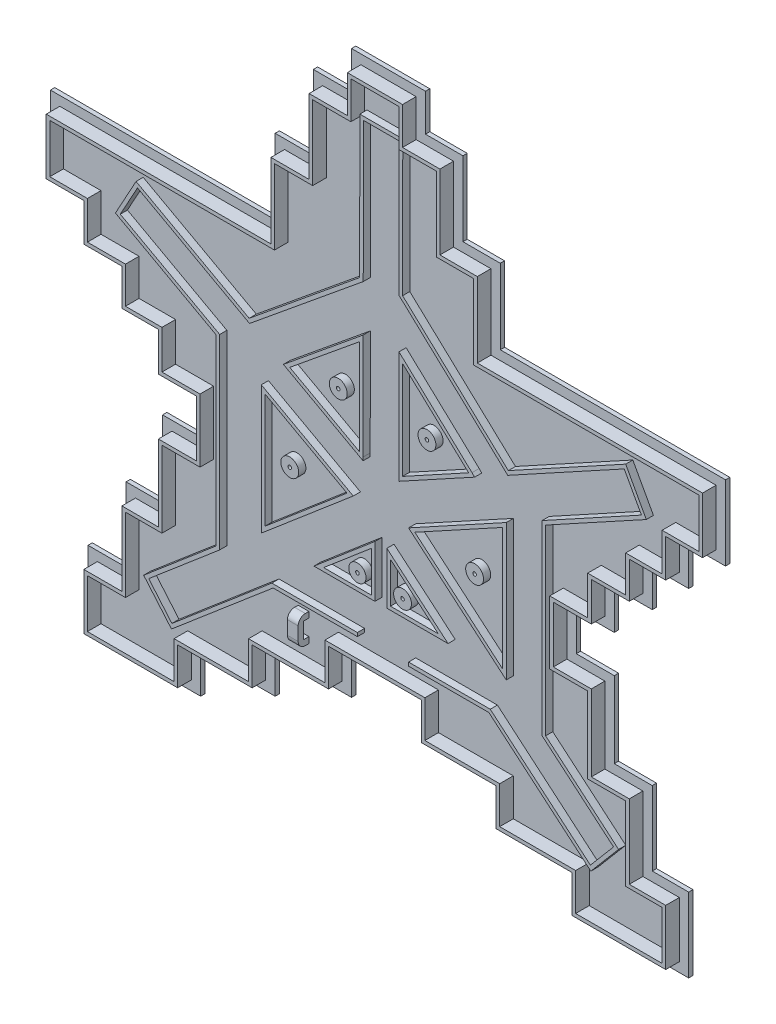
from build123d import *

# Parameters (mm, degrees)
BOSS_EXTRUDE1_DEPTH = 1.2
BOSS_EXTRUDE2_DEPTH = 5
SKETCH7_R           = 2.408517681
SKETCH7_R_2         = 0.5
SKETCH7_R_3         = 2.5
BOSS_EXTRUDE5_DEPTH = 2
SKETCH8_W           = 3
SKETCH8_H           = 7.788245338
BOSS_EXTRUDE6_DEPTH = 3
SKETCH9_W           = 1.552701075
SKETCH9_H           = 4.49127797
CUT_EXTRUDE6_DEPTH  = 5
FILLET6_R           = 2


with BuildPart() as part:
    # Sketch1 → Boss-Extrude1 (new body)
    with BuildSketch(Plane.XY):
        Polygon((-31.468980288, 100.324610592), (-31.468980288, 79.423487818), (-20.95658126, 79.423487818), (-20.95658126, 68.849251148), (-10.320506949, 68.849251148), (-10.320506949, 58.646040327), (-0.117296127, 58.646040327), (-0.117296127, 47.824453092), (10.518778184, 47.824453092), (10.518778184, 37.373891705), (-0.117296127, 37.373891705), (-0.117296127, 16.07112462), (-10.320506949, 16.07112462), (-10.320506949, -4.616109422), (-20.95658126, -4.616109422), (-20.95658126, -25.41279973), (10.518778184, -25.41279973), (10.518778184, -15.014454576), (31.334575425, -15.014454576), (31.334575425, -4.616109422), (52.678547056, -4.616109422), (52.678547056, 5.727507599), (73.365781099, 5.727507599), (73.365781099, -4.616109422), (94.271927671, -4.616109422), (94.271927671, -15.014454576), (115.506443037, -15.014454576), (115.506443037, -25.41279973), (146.920391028, -25.41279973), (146.920391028, -4.616109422), (136.740958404, -4.616109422), (136.740958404, 16.07112462), (126.12370072, 16.07112462), (126.12370072, 37.373891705), (115.506443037, 37.373891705), (115.506443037, 47.824453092), (126.12370072, 47.824453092), (126.12370072, 58.646040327), (136.740958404, 58.646040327), (136.740958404, 68.849251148), (146.920391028, 68.849251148), (146.920391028, 79.423487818), (157.209279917, 79.423487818), (157.209279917, 100.324610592), (94.271927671, 100.324610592), (94.271927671, 121.258595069), (83.818854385, 121.258595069), (83.818854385, 142.055285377), (73.365781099, 142.055285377), (73.365781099, 152.45363053), (52.678547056, 152.45363053), (52.678547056, 142.055285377), (42.00656124, 142.055285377), (42.00656124, 121.258595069), (31.334575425, 121.258595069), (31.334575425, 100.324610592), align=None)
    extrude(amount=BOSS_EXTRUDE1_DEPTH)

    # Sketch1_9 → Boss-Extrude2 (add)
    with BuildSketch(Plane.XY):
        Polygon((-28.843980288, 97.699610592), (-28.843980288, 82.048487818), (-18.33158126, 82.048487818), (-18.33158126, 71.474251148), (-7.695506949, 71.474251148), (-7.695506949, 61.271040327), (2.507703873, 61.271040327), (2.507703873, 50.449453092), (13.143778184, 50.449453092), (13.143778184, 34.748891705), (2.507703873, 34.748891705), (2.507703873, 13.44612462), (-7.695506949, 13.44612462), (-7.695506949, -7.241109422), (-18.33158126, -7.241109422), (-18.33158126, -22.78779973), (7.893778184, -22.78779973), (7.893778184, -12.389454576), (28.709575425, -12.389454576), (28.709575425, -1.991109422), (50.053547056, -1.991109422), (50.053547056, 8.352507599), (75.990781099, 8.352507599), (75.990781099, -1.991109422), (96.896927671, -1.991109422), (96.896927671, -12.389454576), (118.131443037, -12.389454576), (118.131443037, -22.78779973), (144.295391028, -22.78779973), (144.295391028, -7.241109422), (134.115958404, -7.241109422), (134.115958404, 13.44612462), (123.49870072, 13.44612462), (123.49870072, 34.748891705), (112.881443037, 34.748891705), (112.881443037, 50.449453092), (123.49870072, 50.449453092), (123.49870072, 61.271040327), (134.115958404, 61.271040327), (134.115958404, 71.474251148), (144.295391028, 71.474251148), (144.295391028, 82.048487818), (154.584279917, 82.048487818), (154.584279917, 97.699610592), (91.646927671, 97.699610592), (91.646927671, 118.633595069), (81.193854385, 118.633595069), (81.193854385, 139.430285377), (70.740781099, 139.430285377), (70.740781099, 149.82863053), (55.303547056, 149.82863053), (55.303547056, 139.430285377), (44.63156124, 139.430285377), (44.63156124, 118.633595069), (33.959575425, 118.633595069), (33.959575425, 97.699610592), align=None)
        Polygon((153.584279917, 96.699610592), (90.646927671, 96.699610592), (90.646927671, 117.633595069), (80.193854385, 117.633595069), (80.193854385, 138.430285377), (69.740781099, 138.430285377), (69.740781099, 148.82863053), (56.303547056, 148.82863053), (56.303547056, 138.430285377), (45.63156124, 138.430285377), (45.63156124, 117.633595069), (34.959575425, 117.633595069), (34.959575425, 96.699610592), (-27.843980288, 96.699610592), (-27.843980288, 83.048487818), (-17.33158126, 83.048487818), (-17.33158126, 72.474251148), (-6.695506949, 72.474251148), (-6.695506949, 62.271040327), (3.507703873, 62.271040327), (3.507703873, 51.449453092), (14.143778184, 51.449453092), (14.143778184, 33.748891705), (3.507703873, 33.748891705), (3.507703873, 12.44612462), (-6.695506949, 12.44612462), (-6.695506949, -8.241109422), (-17.33158126, -8.241109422), (-17.33158126, -21.78779973), (6.893778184, -21.78779973), (6.893778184, -11.389454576), (27.709575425, -11.389454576), (27.709575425, -0.991109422), (49.053547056, -0.991109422), (49.053547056, 9.352507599), (76.990781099, 9.352507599), (76.990781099, -0.991109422), (97.896927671, -0.991109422), (97.896927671, -11.389454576), (119.131443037, -11.389454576), (119.131443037, -21.78779973), (143.295391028, -21.78779973), (143.295391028, -8.241109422), (133.115958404, -8.241109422), (133.115958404, 12.44612462), (122.49870072, 12.44612462), (122.49870072, 33.748891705), (111.881443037, 33.748891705), (111.881443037, 51.449453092), (122.49870072, 51.449453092), (122.49870072, 62.271040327), (133.115958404, 62.271040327), (133.115958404, 72.474251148), (143.295391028, 72.474251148), (143.295391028, 83.048487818), (153.584279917, 83.048487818), align=None, mode=Mode.SUBTRACT)
    extrude(amount=BOSS_EXTRUDE2_DEPTH)

    # Sketch7 → Boss-Extrude5 (add)
    # profile 1 of 13: a face of its own
    with BuildSketch(Plane.XY.offset(1.2)):
        Polygon((67.948253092, 87.664335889), (67.911442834, 57.203881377), (67.911442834, 56.302360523), (89.090105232, 67.90002077), (88.353073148, 68.636535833), align=None)
        Polygon((87.42276229, 68.127087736), (68.9123943, 57.990613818), (68.945466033, 85.357443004), align=None, mode=Mode.SUBTRACT)
    # profile 2 of 13: a face of its own
    with BuildSketch(Plane.XY.offset(1.2)):
        Polygon((-11.296794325, 81.63498138), (16.844878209, 66.225560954), (16.844878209, 15.125179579), (-3.403951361, -2.080125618), (4.366204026, -11.224778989), (32.777648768, 12.916249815), (56.328190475, 12.916249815), (56.328190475, 13.916249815), (32.410172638, 13.916249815), (4.480745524, -9.815211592), (-1.994383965, -2.194667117), (17.844878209, 14.662631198), (17.844878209, 66.818095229), (-9.939399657, 82.031818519), (-5.13661201, 90.802977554), (26.188262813, 73.650544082), (57.962755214, 99.670870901), (58.009962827, 138.735128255), (68.009970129, 138.735128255), (67.964758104, 101.322218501), (68.963633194, 100.390752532), (98.361274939, 72.977011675), (130.913238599, 90.802812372), (135.716327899, 82.031818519), (107.93431821, 66.818095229), (107.93431821, 14.75133935), (127.919514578, -2.194667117), (121.452210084, -9.82185353), (93.456784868, 13.916249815), (70.624882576, 13.916249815), (70.624882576, 12.916249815), (93.089891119, 12.916249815), (121.568198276, -11.231302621), (129.328963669, -2.078678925), (108.93431821, 15.214510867), (108.93431821, 66.225584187), (137.073736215, 81.635028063), (131.310029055, 92.160220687), (98.514779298, 74.201193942), (68.965283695, 101.756540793), (69.01117932, 139.735128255), (57.011170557, 139.735128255), (56.963327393, 100.144953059), (26.076720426, 74.85172107), (-5.533449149, 92.160372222), align=None)
    # profile 3 of 13: a face of its own
    with BuildSketch(Plane.XY.offset(1.2)):
        Polygon((57.911391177, 56.280040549), (57.911391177, 57.167177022), (57.94712015, 86.732869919), (35.647071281, 68.471223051), align=None)
        Polygon((56.944565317, 84.61935188), (56.912357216, 57.967177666), (37.427290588, 68.636535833), align=None, mode=Mode.SUBTRACT)
    # profile 4 of 13: a face of its own
    with BuildSketch(Plane.XY.offset(1.2)):
        Polygon((29.473122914, 24.543078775), (55.171842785, 46.379122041), (29.473122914, 60.450864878), align=None)
        Polygon((30.473122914, 58.763198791), (53.41673431, 46.200059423), (30.473122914, 26.705014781), align=None, mode=Mode.SUBTRACT)
    # profile 5 of 13: a face of its own
    with BuildSketch(Plane.XY.offset(1.2)):
        Polygon((97.93431821, 61.341989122), (70.624882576, 46.387052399), (97.93431821, 23.23061879), align=None)
        Polygon((96.93431821, 25.389646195), (72.381352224, 46.208792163), (96.93431821, 59.65425686), align=None, mode=Mode.SUBTRACT)
    # profile 6 of 13: a face of its own
    with BuildSketch(Plane.XY.offset(1.2)):
        Polygon((61.240210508, 38.412954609), (44.179117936, 23.916249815), (61.240210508, 23.916249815), align=None)
        Polygon((60.240210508, 24.916249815), (46.900383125, 24.916249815), (60.240210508, 36.251018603), align=None, mode=Mode.SUBTRACT)
    # profile 7 of 13: a face of its own
    with BuildSketch(Plane.XY.offset(1.2)):
        Polygon((64.579575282, 23.916249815), (81.663329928, 23.916249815), (64.564694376, 38.414660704), align=None)
        Polygon((65.56691282, 36.253752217), (78.937745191, 24.916249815), (65.578549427, 24.916249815), align=None, mode=Mode.SUBTRACT)
    # profile 8 of 13: a face of its own
    with BuildSketch(Plane.XY.offset(1.2)):
        with Locations((56.328190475, 28.372721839)):
            Circle(SKETCH7_R)
        with Locations((56.328190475, 28.372721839)):
            Circle(SKETCH7_R_2, mode=Mode.SUBTRACT)
    # profile 9 of 13: a face of its own
    with BuildSketch(Plane.XY.offset(1.2)):
        with Locations((68.945466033, 28.372721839)):
            Circle(SKETCH7_R_3)
        with Locations((68.945466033, 28.372721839)):
            Circle(SKETCH7_R_2, mode=Mode.SUBTRACT)
    # profile 10 of 13: a face of its own
    with BuildSketch(Plane.XY.offset(1.2)):
        with Locations((37.427290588, 44.468761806)):
            Circle(SKETCH7_R_3)
        with Locations((37.427290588, 44.468761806)):
            Circle(SKETCH7_R_2, mode=Mode.SUBTRACT)
    # profile 11 of 13: a face of its own
    with BuildSketch(Plane.XY.offset(1.2)):
        with Locations((89.090105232, 44.468761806)):
            Circle(SKETCH7_R_3)
        with Locations((89.090105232, 44.468761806)):
            Circle(SKETCH7_R_2, mode=Mode.SUBTRACT)
    # profile 12 of 13: a face of its own
    with BuildSketch(Plane.XY.offset(1.2)):
        with Locations((50.983394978, 70.266444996)):
            Circle(SKETCH7_R_3)
        with Locations((50.983394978, 70.266444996)):
            Circle(SKETCH7_R_2, mode=Mode.SUBTRACT)
    # profile 13 of 13: a face of its own
    with BuildSketch(Plane.XY.offset(1.2)):
        with Locations((75.767111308, 70.266444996)):
            Circle(SKETCH7_R_3)
        with Locations((75.767111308, 70.266444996)):
            Circle(SKETCH7_R_2, mode=Mode.SUBTRACT)
    extrude(amount=BOSS_EXTRUDE5_DEPTH)

    # Sketch8 → Boss-Extrude6 (add)
    with BuildSketch(Plane.XY.offset(1.2)):
        with Locations((39.278396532, 6.350298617)):
            Rectangle(SKETCH8_W, SKETCH8_H)
    extrude(amount=BOSS_EXTRUDE6_DEPTH)

    # Sketch9 → Cut-Extrude6 (cut)
    with BuildSketch(Plane(origin=(40.778396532, 0, 0), x_dir=(0, 0, -1), z_dir=(1, 0, 0))):
        with Locations((-1.976350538, 6.403435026)):
            Rectangle(SKETCH9_W, SKETCH9_H)
    extrude(amount=-CUT_EXTRUDE6_DEPTH, mode=Mode.SUBTRACT)

    # Fillet6
    fillet6_edges = [part.edges().sort_by_distance(p)[0] for p in [
        (39.278396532, 2.456175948, 4.2),
        (39.278396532, 10.244421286, 4.2),
    ]]
    fillet(fillet6_edges, radius=FILLET6_R)


solid = part.part
